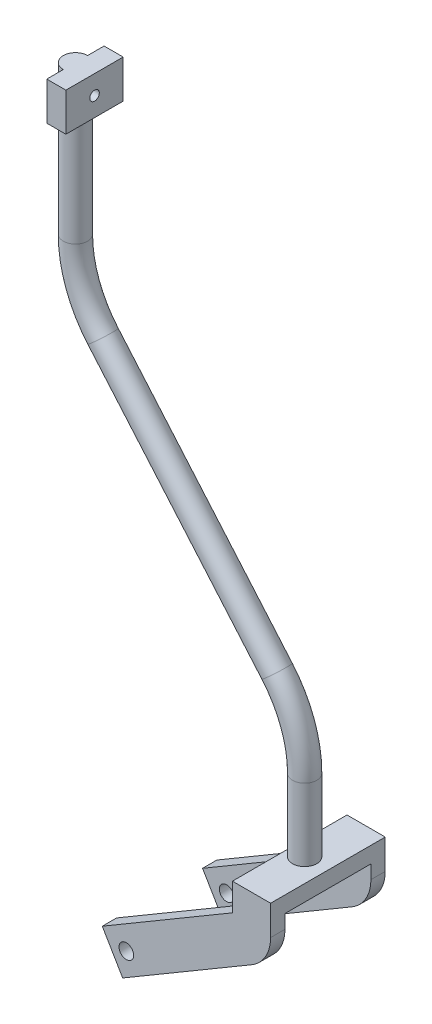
from build123d import *

# Parameters (mm, degrees)
SKETCH2_R           = 16.132175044
SKETCH3_W           = 50.8
SKETCH3_H           = 152.4
BOSS_EXTRUDE1_DEPTH = 12.7
SKETCH5_R           = 9.703692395
BOSS_EXTRUDE3_DEPTH = 152.4
SKETCH6_W           = 114.3
SKETCH6_H           = 163.038110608
CUT_EXTRUDE1_DEPTH  = 1013.603296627
SKETCH7_W           = 76.2
SKETCH7_H           = 50.8
BOSS_EXTRUDE4_DEPTH = 25.4
SKETCH8_R           = 6.35
CUT_EXTRUDE2_DEPTH  = 999.932291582


with BuildPart() as part:
    # Base-Sweep: sweep along a path in Sketch1
    with BuildLine(Plane.XY) as base_sweep_path:
        Line((0, 0), (0, -197.623570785))
        ThreePointArc((0, -197.623570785), (9.466323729, -250.49817894), (36.6892938, -296.804176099))
        Line((36.6892938, -296.804176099), (268.1107062, -566.795823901))
        ThreePointArc((268.1107062, -566.795823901), (295.333676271, -613.10182106), (304.8, -665.976429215))
        Line((304.8, -665.976429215), (304.8, -762))
    # Sketch2 → Base-Sweep (sweep)
    with BuildSketch(Plane(origin=(0, 0, 0), x_dir=(1, 0, 0), z_dir=(0, 1, 0))):
        Circle(SKETCH2_R)
    sweep(path=base_sweep_path.line)

    # Sketch3 → Boss-Extrude1 (add)
    with BuildSketch(Plane.XZ.offset(762)):
        with Locations((310.299081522, 0)):
            Rectangle(SKETCH3_W, SKETCH3_H)
    extrude(amount=BOSS_EXTRUDE1_DEPTH)

    # Sketch5 → Boss-Extrude3 (add)
    with BuildSketch(Plane(origin=(0, 0, -76.2), x_dir=(-1, 0, 0), z_dir=(0, 0, -1))):
        with BuildLine():
            Line((-335.699081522, -774.7), (-335.699081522, -801.578742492))
            ThreePointArc((-335.699081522, -801.578742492), (-329.002798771, -826.787909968), (-310.679312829, -845.351104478))
            Line((-310.679312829, -845.351104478), (-139.017551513, -946.453254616))
            Line((-139.017551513, -946.453254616), (-111.878780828, -900.374222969))
            Line((-111.878780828, -900.374222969), (-284.899081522, -798.471945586))
            Line((-284.899081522, -798.471945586), (-284.899081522, -774.7))
            Line((-284.899081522, -774.7), (-335.699081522, -774.7))
        make_face()
        with Locations((-143.869397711, -913.074222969)):
            Circle(SKETCH5_R, mode=Mode.SUBTRACT)
    extrude(amount=-BOSS_EXTRUDE3_DEPTH)

    # Sketch6 → Cut-Extrude1 (cut, through all)
    with BuildSketch(Plane(origin=(335.699081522, 0, 0), x_dir=(0, 0, -1), z_dir=(1, 0, 0))):
        with Locations((0, -864.934199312)):
            Rectangle(SKETCH6_W, SKETCH6_H)
    extrude(amount=-CUT_EXTRUDE1_DEPTH, mode=Mode.SUBTRACT)

    # Sketch7 → Boss-Extrude4 (add)
    with BuildSketch(Plane(origin=(0, 0, 0), x_dir=(0, 0, -1), z_dir=(1, 0, 0))):
        with Locations((0, -25.4)):
            Rectangle(SKETCH7_W, SKETCH7_H)
    extrude(amount=BOSS_EXTRUDE4_DEPTH)

    # Sketch8 → Cut-Extrude2 (cut, through all)
    with BuildSketch(Plane(origin=(25.4, 0, 0), x_dir=(0, 0, -1), z_dir=(1, 0, 0))):
        with Locations((0, -25.4)):
            Circle(SKETCH8_R)
    extrude(amount=-CUT_EXTRUDE2_DEPTH, mode=Mode.SUBTRACT)


solid = part.part
